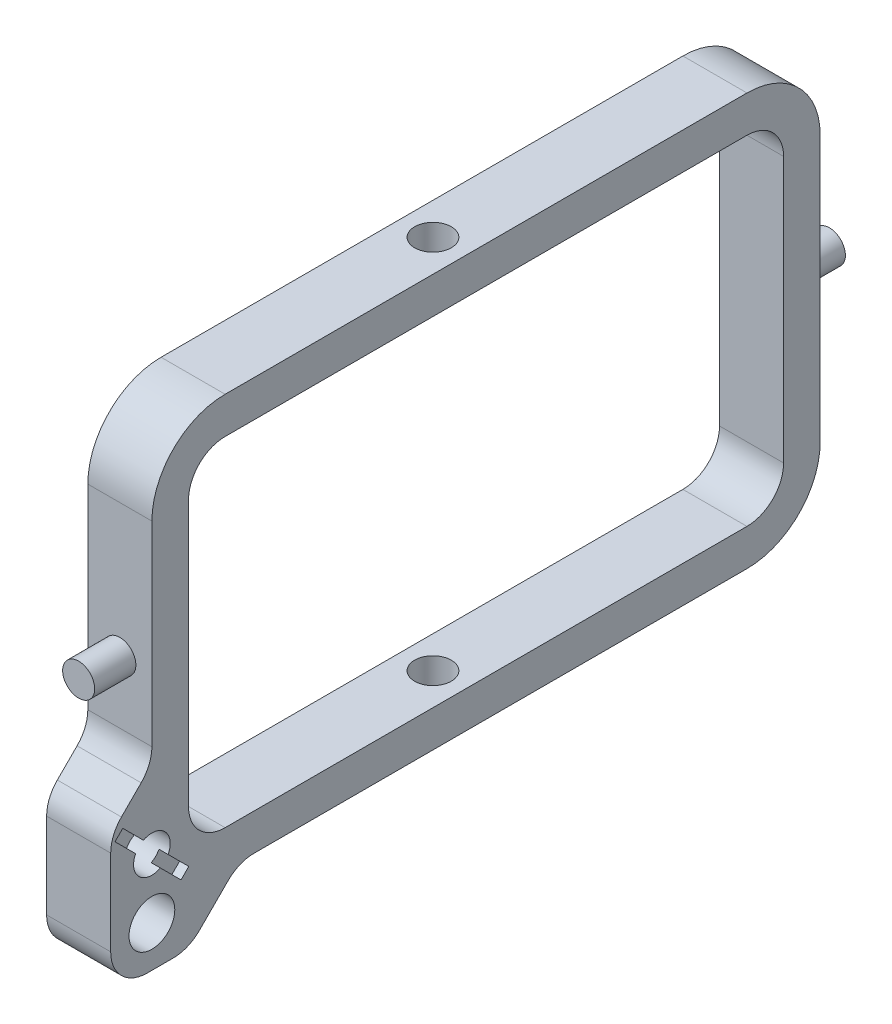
ISO-10303-21;
HEADER;
FILE_DESCRIPTION(('STEP AP214'),'2;1');
FILE_NAME('part.step','',(''),(''),'','','');
FILE_SCHEMA(('AUTOMOTIVE_DESIGN { 1 0 10303 214 1 1 1 1 }'));
ENDSEC;
DATA;
#1=APPLICATION_CONTEXT('core data for automotive mechanical design processes');
#2=APPLICATION_PROTOCOL_DEFINITION('international standard','automotive_design',2000,#1);
#3=PRODUCT_CONTEXT('',#1,'mechanical');
#4=PRODUCT('Part','Part','',(#3));
#5=PRODUCT_RELATED_PRODUCT_CATEGORY('part','',(#4));
#6=PRODUCT_DEFINITION_FORMATION('','',#4);
#7=PRODUCT_DEFINITION_CONTEXT('part definition',#1,'design');
#8=PRODUCT_DEFINITION('design','',#6,#7);
#9=PRODUCT_DEFINITION_SHAPE('','',#8);
#10=(LENGTH_UNIT() NAMED_UNIT(*) SI_UNIT(.MILLI.,.METRE.));
#11=(NAMED_UNIT(*) PLANE_ANGLE_UNIT() SI_UNIT($,.RADIAN.));
#12=(NAMED_UNIT(*) SI_UNIT($,.STERADIAN.) SOLID_ANGLE_UNIT());
#13=UNCERTAINTY_MEASURE_WITH_UNIT(LENGTH_MEASURE(1.E-05),#10,'distance_accuracy_value','');
#14=(GEOMETRIC_REPRESENTATION_CONTEXT(3) GLOBAL_UNCERTAINTY_ASSIGNED_CONTEXT((#13)) GLOBAL_UNIT_ASSIGNED_CONTEXT((#10,
#11,#12)) REPRESENTATION_CONTEXT('',''));
#15=CARTESIAN_POINT('',(0.,0.,0.));
#16=DIRECTION('',(0.,0.,1.));
#17=DIRECTION('',(1.,0.,0.));
#18=AXIS2_PLACEMENT_3D('',#15,#16,#17);
#19=CARTESIAN_POINT('',(7.,0.,0.));
#20=DIRECTION('',(1.,0.,0.));
#21=DIRECTION('',(0.,0.,-1.));
#22=AXIS2_PLACEMENT_3D('',#19,#20,#21);
#23=PLANE('',#22);
#24=DIRECTION('',(0.,0.707106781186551,0.707106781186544));
#25=VECTOR('',#24,1.);
#26=CARTESIAN_POINT('',(7.,-12.9694913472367,76.1819805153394));
#27=LINE('',#26,#25);
#28=CARTESIAN_POINT('',(7.,-20.1819805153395,68.9694913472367));
#29=VERTEX_POINT('',#28);
#30=CARTESIAN_POINT('',(7.,-17.9248096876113,71.2266621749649));
#31=VERTEX_POINT('',#30);
#32=EDGE_CURVE('E294',#29,#31,#27,.T.);
#33=ORIENTED_EDGE('',*,*,#32,.F.);
#34=DIRECTION('',(0.,0.707106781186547,-0.707106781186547));
#35=VECTOR('',#34,1.);
#36=CARTESIAN_POINT('',(7.,-20.1819805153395,68.9694913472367));
#37=LINE('',#36,#35);
#38=CARTESIAN_POINT('',(7.,-21.0305086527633,69.8180194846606));
#39=VERTEX_POINT('',#38);
#40=EDGE_CURVE('E266',#39,#29,#37,.T.);
#41=ORIENTED_EDGE('',*,*,#40,.F.);
#42=DIRECTION('',(0.,-0.70710678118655,-0.707106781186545));
#43=VECTOR('',#42,1.);
#44=CARTESIAN_POINT('',(7.,-21.0305086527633,69.8180194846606));
#45=LINE('',#44,#43);
#46=CARTESIAN_POINT('',(7.,-18.7733378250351,72.0751903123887));
#47=VERTEX_POINT('',#46);
#48=EDGE_CURVE('E300',#47,#39,#45,.T.);
#49=ORIENTED_EDGE('',*,*,#48,.F.);
#50=CARTESIAN_POINT('',(7.,-17.,73.));
#51=DIRECTION('',(1.,0.,0.));
#52=DIRECTION('',(0.,0.,-1.));
#53=AXIS2_PLACEMENT_3D('',#50,#51,#52);
#54=CIRCLE('',#53,2.);
#55=CARTESIAN_POINT('',(7.,-16.0751903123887,74.7733378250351));
#56=VERTEX_POINT('',#55);
#57=EDGE_CURVE('E346',#56,#47,#54,.T.);
#58=ORIENTED_EDGE('',*,*,#57,.F.);
#59=CARTESIAN_POINT('',(7.,-13.8180194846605,77.0305086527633));
#60=VERTEX_POINT('',#59);
#61=EDGE_CURVE('E301',#60,#56,#45,.T.);
#62=ORIENTED_EDGE('',*,*,#61,.F.);
#63=DIRECTION('',(0.,-0.707106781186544,0.707106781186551));
#64=VECTOR('',#63,1.);
#65=CARTESIAN_POINT('',(7.,-13.8180194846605,77.0305086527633));
#66=LINE('',#65,#64);
#67=CARTESIAN_POINT('',(7.,-12.9694913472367,76.1819805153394));
#68=VERTEX_POINT('',#67);
#69=EDGE_CURVE('E297',#68,#60,#66,.T.);
#70=ORIENTED_EDGE('',*,*,#69,.F.);
#71=CARTESIAN_POINT('',(7.,-15.2266621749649,73.9248096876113));
#72=VERTEX_POINT('',#71);
#73=EDGE_CURVE('E272',#72,#68,#27,.T.);
#74=ORIENTED_EDGE('',*,*,#73,.F.);
#75=EDGE_CURVE('E342',#31,#72,#54,.T.);
#76=ORIENTED_EDGE('',*,*,#75,.F.);
#77=EDGE_LOOP('',(#33,#41,#49,#58,#62,#70,#74,#76));
#78=FACE_BOUND('',#77,.T.);
#79=CARTESIAN_POINT('',(7.,-23.5,73.));
#80=DIRECTION('',(1.,0.,0.));
#81=DIRECTION('',(0.,0.,-1.));
#82=AXIS2_PLACEMENT_3D('',#79,#80,#81);
#83=CIRCLE('',#82,2.5);
#84=CARTESIAN_POINT('',(7.,-23.5,70.5));
#85=VERTEX_POINT('',#84);
#86=EDGE_CURVE('E350',#85,#85,#83,.T.);
#87=ORIENTED_EDGE('',*,*,#86,.F.);
#88=EDGE_LOOP('',(#87));
#89=FACE_BOUND('',#88,.T.);
#90=DIRECTION('',(0.,0.,-1.));
#91=VECTOR('',#90,1.);
#92=CARTESIAN_POINT('',(7.,-22.5,63.5));
#93=LINE('',#92,#91);
#94=CARTESIAN_POINT('',(7.,-22.5,61.8431457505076));
#95=VERTEX_POINT('',#94);
#96=CARTESIAN_POINT('',(7.,-22.5,7.99999999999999));
#97=VERTEX_POINT('',#96);
#98=EDGE_CURVE('E407',#95,#97,#93,.T.);
#99=ORIENTED_EDGE('',*,*,#98,.T.);
#100=CARTESIAN_POINT('',(7.,-14.5,8.));
#101=DIRECTION('',(1.,0.,0.));
#102=DIRECTION('',(0.,0.,-1.));
#103=AXIS2_PLACEMENT_3D('',#100,#101,#102);
#104=CIRCLE('',#103,8.);
#105=CARTESIAN_POINT('',(7.,-14.5,0.));
#106=VERTEX_POINT('',#105);
#107=EDGE_CURVE('E567',#97,#106,#104,.T.);
#108=ORIENTED_EDGE('',*,*,#107,.T.);
#109=DIRECTION('',(0.,1.,0.));
#110=VECTOR('',#109,1.);
#111=CARTESIAN_POINT('',(7.,-22.5,0.));
#112=LINE('',#111,#110);
#113=CARTESIAN_POINT('',(7.,14.5,0.));
#114=VERTEX_POINT('',#113);
#115=EDGE_CURVE('E411',#106,#114,#112,.T.);
#116=ORIENTED_EDGE('',*,*,#115,.T.);
#117=CARTESIAN_POINT('',(7.,14.5,8.));
#118=DIRECTION('',(1.,0.,0.));
#119=DIRECTION('',(0.,0.,-1.));
#120=AXIS2_PLACEMENT_3D('',#117,#118,#119);
#121=CIRCLE('',#120,8.);
#122=CARTESIAN_POINT('',(7.,22.5,8.));
#123=VERTEX_POINT('',#122);
#124=EDGE_CURVE('E564',#114,#123,#121,.T.);
#125=ORIENTED_EDGE('',*,*,#124,.T.);
#126=DIRECTION('',(0.,0.,1.));
#127=VECTOR('',#126,1.);
#128=CARTESIAN_POINT('',(7.,22.5,0.));
#129=LINE('',#128,#127);
#130=CARTESIAN_POINT('',(7.,22.5,65.));
#131=VERTEX_POINT('',#130);
#132=EDGE_CURVE('E415',#123,#131,#129,.T.);
#133=ORIENTED_EDGE('',*,*,#132,.T.);
#134=CARTESIAN_POINT('',(7.,14.5,65.));
#135=DIRECTION('',(1.,0.,0.));
#136=DIRECTION('',(0.,0.,-1.));
#137=AXIS2_PLACEMENT_3D('',#134,#135,#136);
#138=CIRCLE('',#137,8.);
#139=CARTESIAN_POINT('',(7.,14.5,73.));
#140=VERTEX_POINT('',#139);
#141=EDGE_CURVE('E561',#131,#140,#138,.T.);
#142=ORIENTED_EDGE('',*,*,#141,.T.);
#143=DIRECTION('',(0.,-1.,0.));
#144=VECTOR('',#143,1.);
#145=CARTESIAN_POINT('',(7.,22.5,73.));
#146=LINE('',#145,#144);
#147=CARTESIAN_POINT('',(7.,-6.84314575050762,73.));
#148=VERTEX_POINT('',#147);
#149=EDGE_CURVE('E419',#140,#148,#146,.T.);
#150=ORIENTED_EDGE('',*,*,#149,.T.);
#151=CARTESIAN_POINT('',(7.,-6.84314575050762,77.));
#152=DIRECTION('',(1.,0.,0.));
#153=DIRECTION('',(0.,0.,-1.));
#154=AXIS2_PLACEMENT_3D('',#151,#152,#153);
#155=CIRCLE('',#154,4.);
#156=CARTESIAN_POINT('',(7.,-9.67157287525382,74.1715728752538));
#157=VERTEX_POINT('',#156);
#158=EDGE_CURVE('E539',#148,#157,#155,.F.);
#159=ORIENTED_EDGE('',*,*,#158,.T.);
#160=DIRECTION('',(0.,-0.707106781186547,0.707106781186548));
#161=VECTOR('',#160,1.);
#162=CARTESIAN_POINT('',(7.,-8.50000000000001,73.));
#163=LINE('',#162,#161);
#164=CARTESIAN_POINT('',(7.,-11.8284271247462,76.3284271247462));
#165=VERTEX_POINT('',#164);
#166=EDGE_CURVE('E390',#157,#165,#163,.T.);
#167=ORIENTED_EDGE('',*,*,#166,.T.);
#168=CARTESIAN_POINT('',(7.,-14.6568542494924,73.5));
#169=DIRECTION('',(1.,0.,0.));
#170=DIRECTION('',(0.,0.,-1.));
#171=AXIS2_PLACEMENT_3D('',#168,#169,#170);
#172=CIRCLE('',#171,4.);
#173=CARTESIAN_POINT('',(7.,-14.6568542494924,77.5));
#174=VERTEX_POINT('',#173);
#175=EDGE_CURVE('E498',#165,#174,#172,.T.);
#176=ORIENTED_EDGE('',*,*,#175,.T.);
#177=DIRECTION('',(0.,-1.,0.));
#178=VECTOR('',#177,1.);
#179=CARTESIAN_POINT('',(7.,-13.,77.5));
#180=LINE('',#179,#178);
#181=CARTESIAN_POINT('',(7.,-24.,77.5));
#182=VERTEX_POINT('',#181);
#183=EDGE_CURVE('E394',#174,#182,#180,.T.);
#184=ORIENTED_EDGE('',*,*,#183,.T.);
#185=CARTESIAN_POINT('',(7.,-24.,73.5));
#186=DIRECTION('',(1.,0.,0.));
#187=DIRECTION('',(0.,0.,-1.));
#188=AXIS2_PLACEMENT_3D('',#185,#186,#187);
#189=CIRCLE('',#188,4.);
#190=CARTESIAN_POINT('',(7.,-28.,73.5));
#191=VERTEX_POINT('',#190);
#192=EDGE_CURVE('E501',#182,#191,#189,.T.);
#193=ORIENTED_EDGE('',*,*,#192,.T.);
#194=DIRECTION('',(0.,0.,-1.));
#195=VECTOR('',#194,1.);
#196=CARTESIAN_POINT('',(7.,-28.,77.5));
#197=LINE('',#196,#195);
#198=CARTESIAN_POINT('',(7.,-28.,70.6568542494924));
#199=VERTEX_POINT('',#198);
#200=EDGE_CURVE('E399',#191,#199,#197,.T.);
#201=ORIENTED_EDGE('',*,*,#200,.T.);
#202=CARTESIAN_POINT('',(7.,-24.,70.6568542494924));
#203=DIRECTION('',(1.,0.,0.));
#204=DIRECTION('',(0.,0.,-1.));
#205=AXIS2_PLACEMENT_3D('',#202,#203,#204);
#206=CIRCLE('',#205,4.);
#207=CARTESIAN_POINT('',(7.,-26.8284271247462,67.8284271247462));
#208=VERTEX_POINT('',#207);
#209=EDGE_CURVE('E504',#199,#208,#206,.T.);
#210=ORIENTED_EDGE('',*,*,#209,.T.);
#211=DIRECTION('',(0.,0.707106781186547,-0.707106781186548));
#212=VECTOR('',#211,1.);
#213=CARTESIAN_POINT('',(7.,-28.,69.));
#214=LINE('',#213,#212);
#215=CARTESIAN_POINT('',(7.,-23.6715728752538,64.6715728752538));
#216=VERTEX_POINT('',#215);
#217=EDGE_CURVE('E403',#208,#216,#214,.T.);
#218=ORIENTED_EDGE('',*,*,#217,.T.);
#219=CARTESIAN_POINT('',(7.,-26.5,61.8431457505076));
#220=DIRECTION('',(1.,0.,0.));
#221=DIRECTION('',(0.,0.,-1.));
#222=AXIS2_PLACEMENT_3D('',#219,#220,#221);
#223=CIRCLE('',#222,4.);
#224=EDGE_CURVE('E532',#216,#95,#223,.F.);
#225=ORIENTED_EDGE('',*,*,#224,.T.);
#226=EDGE_LOOP('',(#99,#108,#116,#125,#133,#142,#150,#159,#167,#176,#184,#193,#201,#210,#218,#225));
#227=FACE_BOUND('',#226,.T.);
#228=DIRECTION('',(0.,-1.,0.));
#229=VECTOR('',#228,1.);
#230=CARTESIAN_POINT('',(7.,18.5,69.));
#231=LINE('',#230,#229);
#232=CARTESIAN_POINT('',(7.,14.5,69.));
#233=VERTEX_POINT('',#232);
#234=CARTESIAN_POINT('',(7.,-14.5,69.));
#235=VERTEX_POINT('',#234);
#236=EDGE_CURVE('E362',#233,#235,#231,.T.);
#237=ORIENTED_EDGE('',*,*,#236,.F.);
#238=CARTESIAN_POINT('',(7.,14.5,65.));
#239=DIRECTION('',(1.,0.,0.));
#240=DIRECTION('',(0.,0.,-1.));
#241=AXIS2_PLACEMENT_3D('',#238,#239,#240);
#242=CIRCLE('',#241,4.);
#243=CARTESIAN_POINT('',(7.,18.5,65.));
#244=VERTEX_POINT('',#243);
#245=EDGE_CURVE('E11',#233,#244,#242,.F.);
#246=ORIENTED_EDGE('',*,*,#245,.T.);
#247=DIRECTION('',(0.,0.,1.));
#248=VECTOR('',#247,1.);
#249=CARTESIAN_POINT('',(7.,18.5,4.));
#250=LINE('',#249,#248);
#251=CARTESIAN_POINT('',(7.,18.5,8.));
#252=VERTEX_POINT('',#251);
#253=EDGE_CURVE('E359',#252,#244,#250,.T.);
#254=ORIENTED_EDGE('',*,*,#253,.F.);
#255=CARTESIAN_POINT('',(7.,14.5,8.));
#256=DIRECTION('',(1.,0.,0.));
#257=DIRECTION('',(0.,0.,-1.));
#258=AXIS2_PLACEMENT_3D('',#255,#256,#257);
#259=CIRCLE('',#258,4.);
#260=CARTESIAN_POINT('',(7.,14.5,4.));
#261=VERTEX_POINT('',#260);
#262=EDGE_CURVE('E623',#252,#261,#259,.F.);
#263=ORIENTED_EDGE('',*,*,#262,.T.);
#264=DIRECTION('',(0.,1.,0.));
#265=VECTOR('',#264,1.);
#266=CARTESIAN_POINT('',(7.,-18.5,4.));
#267=LINE('',#266,#265);
#268=CARTESIAN_POINT('',(7.,-14.5,4.));
#269=VERTEX_POINT('',#268);
#270=EDGE_CURVE('E371',#269,#261,#267,.T.);
#271=ORIENTED_EDGE('',*,*,#270,.F.);
#272=CARTESIAN_POINT('',(7.,-14.5,8.00000000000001));
#273=DIRECTION('',(1.,0.,0.));
#274=DIRECTION('',(0.,0.,-1.));
#275=AXIS2_PLACEMENT_3D('',#272,#273,#274);
#276=CIRCLE('',#275,4.);
#277=CARTESIAN_POINT('',(7.,-18.5,8.00000000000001));
#278=VERTEX_POINT('',#277);
#279=EDGE_CURVE('E617',#269,#278,#276,.F.);
#280=ORIENTED_EDGE('',*,*,#279,.T.);
#281=DIRECTION('',(0.,0.,-1.));
#282=VECTOR('',#281,1.);
#283=CARTESIAN_POINT('',(7.,-18.5,69.));
#284=LINE('',#283,#282);
#285=CARTESIAN_POINT('',(7.,-18.5,65.));
#286=VERTEX_POINT('',#285);
#287=EDGE_CURVE('E367',#286,#278,#284,.T.);
#288=ORIENTED_EDGE('',*,*,#287,.F.);
#289=CARTESIAN_POINT('',(7.,-14.5,65.));
#290=DIRECTION('',(1.,0.,0.));
#291=DIRECTION('',(0.,0.,-1.));
#292=AXIS2_PLACEMENT_3D('',#289,#290,#291);
#293=CIRCLE('',#292,4.);
#294=EDGE_CURVE('E611',#286,#235,#293,.F.);
#295=ORIENTED_EDGE('',*,*,#294,.T.);
#296=EDGE_LOOP('',(#237,#246,#254,#263,#271,#280,#288,#295));
#297=FACE_BOUND('',#296,.T.);
#298=ADVANCED_FACE('F45',(#78,#89,#227,#297),#23,.T.);
#299=CARTESIAN_POINT('',(0.,0.,0.));
#300=DIRECTION('',(1.,0.,0.));
#301=DIRECTION('',(0.,0.,-1.));
#302=AXIS2_PLACEMENT_3D('',#299,#300,#301);
#303=PLANE('',#302);
#304=DIRECTION('',(0.,1.,0.));
#305=VECTOR('',#304,1.);
#306=CARTESIAN_POINT('',(0.,-22.5,0.));
#307=LINE('',#306,#305);
#308=CARTESIAN_POINT('',(0.,-14.5,0.));
#309=VERTEX_POINT('',#308);
#310=CARTESIAN_POINT('',(0.,14.5,0.));
#311=VERTEX_POINT('',#310);
#312=EDGE_CURVE('E442',#309,#311,#307,.T.);
#313=ORIENTED_EDGE('',*,*,#312,.F.);
#314=CARTESIAN_POINT('',(0.,-14.5,8.));
#315=DIRECTION('',(1.,0.,0.));
#316=DIRECTION('',(0.,0.,-1.));
#317=AXIS2_PLACEMENT_3D('',#314,#315,#316);
#318=CIRCLE('',#317,8.);
#319=CARTESIAN_POINT('',(0.,-22.5,7.99999999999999));
#320=VERTEX_POINT('',#319);
#321=EDGE_CURVE('E555',#309,#320,#318,.F.);
#322=ORIENTED_EDGE('',*,*,#321,.T.);
#323=DIRECTION('',(0.,0.,-1.));
#324=VECTOR('',#323,1.);
#325=CARTESIAN_POINT('',(0.,-22.5,63.5));
#326=LINE('',#325,#324);
#327=CARTESIAN_POINT('',(0.,-22.5,61.8431457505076));
#328=VERTEX_POINT('',#327);
#329=EDGE_CURVE('E438',#328,#320,#326,.T.);
#330=ORIENTED_EDGE('',*,*,#329,.F.);
#331=CARTESIAN_POINT('',(0.,-26.5,61.8431457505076));
#332=DIRECTION('',(1.,0.,0.));
#333=DIRECTION('',(0.,0.,-1.));
#334=AXIS2_PLACEMENT_3D('',#331,#332,#333);
#335=CIRCLE('',#334,4.);
#336=CARTESIAN_POINT('',(0.,-23.6715728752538,64.6715728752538));
#337=VERTEX_POINT('',#336);
#338=EDGE_CURVE('E529',#328,#337,#335,.T.);
#339=ORIENTED_EDGE('',*,*,#338,.T.);
#340=DIRECTION('',(0.,0.707106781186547,-0.707106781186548));
#341=VECTOR('',#340,1.);
#342=CARTESIAN_POINT('',(0.,-28.,69.));
#343=LINE('',#342,#341);
#344=CARTESIAN_POINT('',(0.,-26.8284271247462,67.8284271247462));
#345=VERTEX_POINT('',#344);
#346=EDGE_CURVE('E434',#345,#337,#343,.T.);
#347=ORIENTED_EDGE('',*,*,#346,.F.);
#348=CARTESIAN_POINT('',(0.,-24.,70.6568542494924));
#349=DIRECTION('',(1.,0.,0.));
#350=DIRECTION('',(0.,0.,-1.));
#351=AXIS2_PLACEMENT_3D('',#348,#349,#350);
#352=CIRCLE('',#351,4.);
#353=CARTESIAN_POINT('',(0.,-28.,70.6568542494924));
#354=VERTEX_POINT('',#353);
#355=EDGE_CURVE('E488',#345,#354,#352,.F.);
#356=ORIENTED_EDGE('',*,*,#355,.T.);
#357=DIRECTION('',(0.,0.,-1.));
#358=VECTOR('',#357,1.);
#359=CARTESIAN_POINT('',(0.,-28.,77.5));
#360=LINE('',#359,#358);
#361=CARTESIAN_POINT('',(0.,-28.,73.5));
#362=VERTEX_POINT('',#361);
#363=EDGE_CURVE('E430',#362,#354,#360,.T.);
#364=ORIENTED_EDGE('',*,*,#363,.F.);
#365=CARTESIAN_POINT('',(0.,-24.,73.5));
#366=DIRECTION('',(1.,0.,0.));
#367=DIRECTION('',(0.,0.,-1.));
#368=AXIS2_PLACEMENT_3D('',#365,#366,#367);
#369=CIRCLE('',#368,4.);
#370=CARTESIAN_POINT('',(0.,-24.,77.5));
#371=VERTEX_POINT('',#370);
#372=EDGE_CURVE('E485',#362,#371,#369,.F.);
#373=ORIENTED_EDGE('',*,*,#372,.T.);
#374=DIRECTION('',(0.,-1.,0.));
#375=VECTOR('',#374,1.);
#376=CARTESIAN_POINT('',(0.,-13.,77.5));
#377=LINE('',#376,#375);
#378=CARTESIAN_POINT('',(0.,-14.6568542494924,77.5));
#379=VERTEX_POINT('',#378);
#380=EDGE_CURVE('E426',#379,#371,#377,.T.);
#381=ORIENTED_EDGE('',*,*,#380,.F.);
#382=CARTESIAN_POINT('',(0.,-14.6568542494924,73.5));
#383=DIRECTION('',(1.,0.,0.));
#384=DIRECTION('',(0.,0.,-1.));
#385=AXIS2_PLACEMENT_3D('',#382,#383,#384);
#386=CIRCLE('',#385,4.);
#387=CARTESIAN_POINT('',(0.,-11.8284271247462,76.3284271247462));
#388=VERTEX_POINT('',#387);
#389=EDGE_CURVE('E482',#379,#388,#386,.F.);
#390=ORIENTED_EDGE('',*,*,#389,.T.);
#391=DIRECTION('',(0.,-0.707106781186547,0.707106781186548));
#392=VECTOR('',#391,1.);
#393=CARTESIAN_POINT('',(0.,-8.50000000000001,73.));
#394=LINE('',#393,#392);
#395=CARTESIAN_POINT('',(0.,-9.67157287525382,74.1715728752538));
#396=VERTEX_POINT('',#395);
#397=EDGE_CURVE('E375',#396,#388,#394,.T.);
#398=ORIENTED_EDGE('',*,*,#397,.F.);
#399=CARTESIAN_POINT('',(0.,-6.84314575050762,77.));
#400=DIRECTION('',(1.,0.,0.));
#401=DIRECTION('',(0.,0.,-1.));
#402=AXIS2_PLACEMENT_3D('',#399,#400,#401);
#403=CIRCLE('',#402,4.);
#404=CARTESIAN_POINT('',(0.,-6.84314575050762,73.));
#405=VERTEX_POINT('',#404);
#406=EDGE_CURVE('E535',#396,#405,#403,.T.);
#407=ORIENTED_EDGE('',*,*,#406,.T.);
#408=DIRECTION('',(0.,-1.,0.));
#409=VECTOR('',#408,1.);
#410=CARTESIAN_POINT('',(0.,22.5,73.));
#411=LINE('',#410,#409);
#412=CARTESIAN_POINT('',(0.,14.5,73.));
#413=VERTEX_POINT('',#412);
#414=EDGE_CURVE('E395',#413,#405,#411,.T.);
#415=ORIENTED_EDGE('',*,*,#414,.F.);
#416=CARTESIAN_POINT('',(0.,14.5,65.));
#417=DIRECTION('',(1.,0.,0.));
#418=DIRECTION('',(0.,0.,-1.));
#419=AXIS2_PLACEMENT_3D('',#416,#417,#418);
#420=CIRCLE('',#419,8.);
#421=CARTESIAN_POINT('',(0.,22.5,65.));
#422=VERTEX_POINT('',#421);
#423=EDGE_CURVE('E549',#413,#422,#420,.F.);
#424=ORIENTED_EDGE('',*,*,#423,.T.);
#425=DIRECTION('',(0.,0.,1.));
#426=VECTOR('',#425,1.);
#427=CARTESIAN_POINT('',(0.,22.5,0.));
#428=LINE('',#427,#426);
#429=CARTESIAN_POINT('',(0.,22.5,8.));
#430=VERTEX_POINT('',#429);
#431=EDGE_CURVE('E446',#430,#422,#428,.T.);
#432=ORIENTED_EDGE('',*,*,#431,.F.);
#433=CARTESIAN_POINT('',(0.,14.5,8.));
#434=DIRECTION('',(1.,0.,0.));
#435=DIRECTION('',(0.,0.,-1.));
#436=AXIS2_PLACEMENT_3D('',#433,#434,#435);
#437=CIRCLE('',#436,8.);
#438=EDGE_CURVE('E552',#430,#311,#437,.F.);
#439=ORIENTED_EDGE('',*,*,#438,.T.);
#440=EDGE_LOOP('',(#313,#322,#330,#339,#347,#356,#364,#373,#381,#390,#398,#407,#415,#424,#432,#439));
#441=FACE_BOUND('',#440,.T.);
#442=DIRECTION('',(0.,1.,0.));
#443=VECTOR('',#442,1.);
#444=CARTESIAN_POINT('',(0.,-18.5,4.));
#445=LINE('',#444,#443);
#446=CARTESIAN_POINT('',(0.,-14.5,4.));
#447=VERTEX_POINT('',#446);
#448=CARTESIAN_POINT('',(0.,14.5,4.));
#449=VERTEX_POINT('',#448);
#450=EDGE_CURVE('E363',#447,#449,#445,.T.);
#451=ORIENTED_EDGE('',*,*,#450,.T.);
#452=CARTESIAN_POINT('',(0.,14.5,8.));
#453=DIRECTION('',(1.,0.,0.));
#454=DIRECTION('',(0.,0.,-1.));
#455=AXIS2_PLACEMENT_3D('',#452,#453,#454);
#456=CIRCLE('',#455,4.);
#457=CARTESIAN_POINT('',(0.,18.5,8.));
#458=VERTEX_POINT('',#457);
#459=EDGE_CURVE('E620',#449,#458,#456,.T.);
#460=ORIENTED_EDGE('',*,*,#459,.T.);
#461=DIRECTION('',(0.,0.,1.));
#462=VECTOR('',#461,1.);
#463=CARTESIAN_POINT('',(0.,18.5,4.));
#464=LINE('',#463,#462);
#465=CARTESIAN_POINT('',(0.,18.5,65.));
#466=VERTEX_POINT('',#465);
#467=EDGE_CURVE('E354',#458,#466,#464,.T.);
#468=ORIENTED_EDGE('',*,*,#467,.T.);
#469=CARTESIAN_POINT('',(0.,14.5,65.));
#470=DIRECTION('',(1.,0.,0.));
#471=DIRECTION('',(0.,0.,-1.));
#472=AXIS2_PLACEMENT_3D('',#469,#470,#471);
#473=CIRCLE('',#472,4.);
#474=CARTESIAN_POINT('',(0.,14.5,69.));
#475=VERTEX_POINT('',#474);
#476=EDGE_CURVE('E54',#466,#475,#473,.T.);
#477=ORIENTED_EDGE('',*,*,#476,.T.);
#478=DIRECTION('',(0.,-1.,0.));
#479=VECTOR('',#478,1.);
#480=CARTESIAN_POINT('',(0.,18.5,69.));
#481=LINE('',#480,#479);
#482=CARTESIAN_POINT('',(0.,-14.5,69.));
#483=VERTEX_POINT('',#482);
#484=EDGE_CURVE('E379',#475,#483,#481,.T.);
#485=ORIENTED_EDGE('',*,*,#484,.T.);
#486=CARTESIAN_POINT('',(0.,-14.5,65.));
#487=DIRECTION('',(1.,0.,0.));
#488=DIRECTION('',(0.,0.,-1.));
#489=AXIS2_PLACEMENT_3D('',#486,#487,#488);
#490=CIRCLE('',#489,4.);
#491=CARTESIAN_POINT('',(0.,-18.5,65.));
#492=VERTEX_POINT('',#491);
#493=EDGE_CURVE('E608',#483,#492,#490,.T.);
#494=ORIENTED_EDGE('',*,*,#493,.T.);
#495=DIRECTION('',(0.,0.,-1.));
#496=VECTOR('',#495,1.);
#497=CARTESIAN_POINT('',(0.,-18.5,69.));
#498=LINE('',#497,#496);
#499=CARTESIAN_POINT('',(0.,-18.5,8.00000000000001));
#500=VERTEX_POINT('',#499);
#501=EDGE_CURVE('E383',#492,#500,#498,.T.);
#502=ORIENTED_EDGE('',*,*,#501,.T.);
#503=CARTESIAN_POINT('',(0.,-14.5,8.00000000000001));
#504=DIRECTION('',(1.,0.,0.));
#505=DIRECTION('',(0.,0.,-1.));
#506=AXIS2_PLACEMENT_3D('',#503,#504,#505);
#507=CIRCLE('',#506,4.);
#508=EDGE_CURVE('E614',#500,#447,#507,.T.);
#509=ORIENTED_EDGE('',*,*,#508,.T.);
#510=EDGE_LOOP('',(#451,#460,#468,#477,#485,#494,#502,#509));
#511=FACE_BOUND('',#510,.T.);
#512=CARTESIAN_POINT('',(0.,-23.5,73.));
#513=DIRECTION('',(1.,0.,0.));
#514=DIRECTION('',(0.,0.,-1.));
#515=AXIS2_PLACEMENT_3D('',#512,#513,#514);
#516=CIRCLE('',#515,2.5);
#517=CARTESIAN_POINT('',(0.,-23.5,70.5));
#518=VERTEX_POINT('',#517);
#519=EDGE_CURVE('E355',#518,#518,#516,.T.);
#520=ORIENTED_EDGE('',*,*,#519,.T.);
#521=EDGE_LOOP('',(#520));
#522=FACE_BOUND('',#521,.T.);
#523=CARTESIAN_POINT('',(0.,-17.,73.));
#524=DIRECTION('',(1.,0.,0.));
#525=DIRECTION('',(0.,0.,-1.));
#526=AXIS2_PLACEMENT_3D('',#523,#524,#525);
#527=CIRCLE('',#526,2.);
#528=CARTESIAN_POINT('',(0.,-17.,71.));
#529=VERTEX_POINT('',#528);
#530=EDGE_CURVE('E341',#529,#529,#527,.T.);
#531=ORIENTED_EDGE('',*,*,#530,.T.);
#532=EDGE_LOOP('',(#531));
#533=FACE_BOUND('',#532,.T.);
#534=ADVANCED_FACE('F628',(#441,#511,#522,#533),#303,.F.);
#535=CARTESIAN_POINT('',(7.,-8.50000000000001,73.));
#536=DIRECTION('',(0.,-0.707106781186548,-0.707106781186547));
#537=DIRECTION('',(0.,0.707106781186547,-0.707106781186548));
#538=AXIS2_PLACEMENT_3D('',#535,#536,#537);
#539=PLANE('',#538);
#540=ORIENTED_EDGE('',*,*,#397,.T.);
#541=DIRECTION('',(-1.,0.,0.));
#542=VECTOR('',#541,1.);
#543=CARTESIAN_POINT('',(7.,-11.8284271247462,76.3284271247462));
#544=LINE('',#543,#542);
#545=EDGE_CURVE('E522',#388,#165,#544,.F.);
#546=ORIENTED_EDGE('',*,*,#545,.T.);
#547=ORIENTED_EDGE('',*,*,#166,.F.);
#548=DIRECTION('',(-1.,0.,0.));
#549=VECTOR('',#548,1.);
#550=CARTESIAN_POINT('',(0.,-9.67157287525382,74.1715728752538));
#551=LINE('',#550,#549);
#552=EDGE_CURVE('E518',#157,#396,#551,.T.);
#553=ORIENTED_EDGE('',*,*,#552,.T.);
#554=EDGE_LOOP('',(#540,#546,#547,#553));
#555=FACE_BOUND('',#554,.T.);
#556=ADVANCED_FACE('F676',(#555),#539,.F.);
#557=CARTESIAN_POINT('',(7.,-13.,77.5));
#558=DIRECTION('',(0.,0.,-1.));
#559=DIRECTION('',(-1.,0.,0.));
#560=AXIS2_PLACEMENT_3D('',#557,#558,#559);
#561=PLANE('',#560);
#562=ORIENTED_EDGE('',*,*,#380,.T.);
#563=DIRECTION('',(-1.,0.,0.));
#564=VECTOR('',#563,1.);
#565=CARTESIAN_POINT('',(7.,-24.,77.5));
#566=LINE('',#565,#564);
#567=EDGE_CURVE('E515',#371,#182,#566,.F.);
#568=ORIENTED_EDGE('',*,*,#567,.T.);
#569=ORIENTED_EDGE('',*,*,#183,.F.);
#570=DIRECTION('',(-1.,0.,0.));
#571=VECTOR('',#570,1.);
#572=CARTESIAN_POINT('',(7.,-14.6568542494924,77.5));
#573=LINE('',#572,#571);
#574=EDGE_CURVE('E511',#174,#379,#573,.T.);
#575=ORIENTED_EDGE('',*,*,#574,.T.);
#576=EDGE_LOOP('',(#562,#568,#569,#575));
#577=FACE_BOUND('',#576,.T.);
#578=ADVANCED_FACE('F707',(#577),#561,.F.);
#579=CARTESIAN_POINT('',(7.,-28.,77.5));
#580=DIRECTION('',(0.,1.,0.));
#581=DIRECTION('',(0.,0.,1.));
#582=AXIS2_PLACEMENT_3D('',#579,#580,#581);
#583=PLANE('',#582);
#584=ORIENTED_EDGE('',*,*,#363,.T.);
#585=DIRECTION('',(-1.,0.,0.));
#586=VECTOR('',#585,1.);
#587=CARTESIAN_POINT('',(7.,-28.,70.6568542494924));
#588=LINE('',#587,#586);
#589=EDGE_CURVE('E495',#354,#199,#588,.F.);
#590=ORIENTED_EDGE('',*,*,#589,.T.);
#591=ORIENTED_EDGE('',*,*,#200,.F.);
#592=DIRECTION('',(-1.,0.,0.));
#593=VECTOR('',#592,1.);
#594=CARTESIAN_POINT('',(7.,-28.,73.5));
#595=LINE('',#594,#593);
#596=EDGE_CURVE('E491',#191,#362,#595,.T.);
#597=ORIENTED_EDGE('',*,*,#596,.T.);
#598=EDGE_LOOP('',(#584,#590,#591,#597));
#599=FACE_BOUND('',#598,.T.);
#600=ADVANCED_FACE('F703',(#599),#583,.F.);
#601=CARTESIAN_POINT('',(7.,-28.,69.));
#602=DIRECTION('',(0.,0.707106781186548,0.707106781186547));
#603=DIRECTION('',(0.,-0.707106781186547,0.707106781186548));
#604=AXIS2_PLACEMENT_3D('',#601,#602,#603);
#605=PLANE('',#604);
#606=ORIENTED_EDGE('',*,*,#217,.F.);
#607=DIRECTION('',(-1.,0.,0.));
#608=VECTOR('',#607,1.);
#609=CARTESIAN_POINT('',(7.,-26.8284271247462,67.8284271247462));
#610=LINE('',#609,#608);
#611=EDGE_CURVE('E478',#208,#345,#610,.T.);
#612=ORIENTED_EDGE('',*,*,#611,.T.);
#613=ORIENTED_EDGE('',*,*,#346,.T.);
#614=DIRECTION('',(-1.,0.,0.));
#615=VECTOR('',#614,1.);
#616=CARTESIAN_POINT('',(7.,-23.6715728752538,64.6715728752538));
#617=LINE('',#616,#615);
#618=EDGE_CURVE('E475',#337,#216,#617,.F.);
#619=ORIENTED_EDGE('',*,*,#618,.T.);
#620=EDGE_LOOP('',(#606,#612,#613,#619));
#621=FACE_BOUND('',#620,.T.);
#622=ADVANCED_FACE('F699',(#621),#605,.F.);
#623=CARTESIAN_POINT('',(7.,-22.5,63.5));
#624=DIRECTION('',(0.,1.,0.));
#625=DIRECTION('',(0.,0.,1.));
#626=AXIS2_PLACEMENT_3D('',#623,#624,#625);
#627=PLANE('',#626);
#628=CARTESIAN_POINT('',(3.5,-22.5,38.8));
#629=DIRECTION('',(0.,-1.,0.));
#630=DIRECTION('',(0.,0.,-1.));
#631=AXIS2_PLACEMENT_3D('',#628,#629,#630);
#632=CIRCLE('',#631,2.);
#633=CARTESIAN_POINT('',(3.5,-22.5,36.8));
#634=VERTEX_POINT('',#633);
#635=EDGE_CURVE('E328',#634,#634,#632,.T.);
#636=ORIENTED_EDGE('',*,*,#635,.F.);
#637=EDGE_LOOP('',(#636));
#638=FACE_BOUND('',#637,.T.);
#639=ORIENTED_EDGE('',*,*,#329,.T.);
#640=DIRECTION('',(-1.,0.,0.));
#641=VECTOR('',#640,1.);
#642=CARTESIAN_POINT('',(7.,-22.5,7.99999999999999));
#643=LINE('',#642,#641);
#644=EDGE_CURVE('E558',#320,#97,#643,.F.);
#645=ORIENTED_EDGE('',*,*,#644,.T.);
#646=ORIENTED_EDGE('',*,*,#98,.F.);
#647=DIRECTION('',(-1.,0.,0.));
#648=VECTOR('',#647,1.);
#649=CARTESIAN_POINT('',(0.,-22.5,61.8431457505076));
#650=LINE('',#649,#648);
#651=EDGE_CURVE('E507',#95,#328,#650,.T.);
#652=ORIENTED_EDGE('',*,*,#651,.T.);
#653=EDGE_LOOP('',(#639,#645,#646,#652));
#654=FACE_BOUND('',#653,.T.);
#655=ADVANCED_FACE('F695',(#638,#654),#627,.F.);
#656=CARTESIAN_POINT('',(7.,-22.5,0.));
#657=DIRECTION('',(0.,0.,1.));
#658=DIRECTION('',(1.,0.,0.));
#659=AXIS2_PLACEMENT_3D('',#656,#657,#658);
#660=PLANE('',#659);
#661=CARTESIAN_POINT('',(3.5,0.,0.));
#662=DIRECTION('',(0.,0.,1.));
#663=DIRECTION('',(1.,0.,0.));
#664=AXIS2_PLACEMENT_3D('',#661,#662,#663);
#665=CIRCLE('',#664,1.75);
#666=CARTESIAN_POINT('',(5.25,0.,0.));
#667=VERTEX_POINT('',#666);
#668=EDGE_CURVE('E422',#667,#667,#665,.F.);
#669=ORIENTED_EDGE('',*,*,#668,.F.);
#670=EDGE_LOOP('',(#669));
#671=FACE_BOUND('',#670,.T.);
#672=ORIENTED_EDGE('',*,*,#115,.F.);
#673=DIRECTION('',(-1.,0.,0.));
#674=VECTOR('',#673,1.);
#675=CARTESIAN_POINT('',(7.,-14.5,0.));
#676=LINE('',#675,#674);
#677=EDGE_CURVE('E545',#106,#309,#676,.T.);
#678=ORIENTED_EDGE('',*,*,#677,.T.);
#679=ORIENTED_EDGE('',*,*,#312,.T.);
#680=DIRECTION('',(-1.,0.,0.));
#681=VECTOR('',#680,1.);
#682=CARTESIAN_POINT('',(7.,14.5,0.));
#683=LINE('',#682,#681);
#684=EDGE_CURVE('E542',#311,#114,#683,.F.);
#685=ORIENTED_EDGE('',*,*,#684,.T.);
#686=EDGE_LOOP('',(#672,#678,#679,#685));
#687=FACE_BOUND('',#686,.T.);
#688=ADVANCED_FACE('F691',(#671,#687),#660,.F.);
#689=CARTESIAN_POINT('',(7.,22.5,0.));
#690=DIRECTION('',(0.,-1.,0.));
#691=DIRECTION('',(0.,0.,-1.));
#692=AXIS2_PLACEMENT_3D('',#689,#690,#691);
#693=PLANE('',#692);
#694=CARTESIAN_POINT('',(3.5,22.5,38.8));
#695=DIRECTION('',(0.,-1.,0.));
#696=DIRECTION('',(0.,0.,-1.));
#697=AXIS2_PLACEMENT_3D('',#694,#695,#696);
#698=CIRCLE('',#697,2.);
#699=CARTESIAN_POINT('',(3.5,22.5,36.8));
#700=VERTEX_POINT('',#699);
#701=EDGE_CURVE('E329',#700,#700,#698,.T.);
#702=ORIENTED_EDGE('',*,*,#701,.T.);
#703=EDGE_LOOP('',(#702));
#704=FACE_BOUND('',#703,.T.);
#705=ORIENTED_EDGE('',*,*,#132,.F.);
#706=DIRECTION('',(-1.,0.,0.));
#707=VECTOR('',#706,1.);
#708=CARTESIAN_POINT('',(7.,22.5,8.));
#709=LINE('',#708,#707);
#710=EDGE_CURVE('E573',#123,#430,#709,.T.);
#711=ORIENTED_EDGE('',*,*,#710,.T.);
#712=ORIENTED_EDGE('',*,*,#431,.T.);
#713=DIRECTION('',(-1.,0.,0.));
#714=VECTOR('',#713,1.);
#715=CARTESIAN_POINT('',(7.,22.5,65.));
#716=LINE('',#715,#714);
#717=EDGE_CURVE('E570',#422,#131,#716,.F.);
#718=ORIENTED_EDGE('',*,*,#717,.T.);
#719=EDGE_LOOP('',(#705,#711,#712,#718));
#720=FACE_BOUND('',#719,.T.);
#721=ADVANCED_FACE('F687',(#704,#720),#693,.F.);
#722=CARTESIAN_POINT('',(7.,22.5,73.));
#723=DIRECTION('',(0.,0.,-1.));
#724=DIRECTION('',(-1.,0.,0.));
#725=AXIS2_PLACEMENT_3D('',#722,#723,#724);
#726=PLANE('',#725);
#727=CARTESIAN_POINT('',(3.5,0.,73.));
#728=DIRECTION('',(0.,0.,-1.));
#729=DIRECTION('',(-1.,0.,0.));
#730=AXIS2_PLACEMENT_3D('',#727,#728,#729);
#731=CIRCLE('',#730,1.75);
#732=CARTESIAN_POINT('',(1.75,0.,73.));
#733=VERTEX_POINT('',#732);
#734=EDGE_CURVE('E310',#733,#733,#731,.T.);
#735=ORIENTED_EDGE('',*,*,#734,.T.);
#736=EDGE_LOOP('',(#735));
#737=FACE_BOUND('',#736,.T.);
#738=ORIENTED_EDGE('',*,*,#149,.F.);
#739=DIRECTION('',(-1.,0.,0.));
#740=VECTOR('',#739,1.);
#741=CARTESIAN_POINT('',(7.,14.5,73.));
#742=LINE('',#741,#740);
#743=EDGE_CURVE('E577',#140,#413,#742,.T.);
#744=ORIENTED_EDGE('',*,*,#743,.T.);
#745=ORIENTED_EDGE('',*,*,#414,.T.);
#746=DIRECTION('',(-1.,0.,0.));
#747=VECTOR('',#746,1.);
#748=CARTESIAN_POINT('',(7.,-6.84314575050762,73.));
#749=LINE('',#748,#747);
#750=EDGE_CURVE('E525',#405,#148,#749,.F.);
#751=ORIENTED_EDGE('',*,*,#750,.T.);
#752=EDGE_LOOP('',(#738,#744,#745,#751));
#753=FACE_BOUND('',#752,.T.);
#754=ADVANCED_FACE('F684',(#737,#753),#726,.F.);
#755=CARTESIAN_POINT('',(7.,18.5,4.));
#756=DIRECTION('',(0.,-1.,0.));
#757=DIRECTION('',(0.,0.,-1.));
#758=AXIS2_PLACEMENT_3D('',#755,#756,#757);
#759=PLANE('',#758);
#760=CARTESIAN_POINT('',(3.5,18.5,38.8));
#761=DIRECTION('',(0.,-1.,0.));
#762=DIRECTION('',(0.,0.,-1.));
#763=AXIS2_PLACEMENT_3D('',#760,#761,#762);
#764=CIRCLE('',#763,2.);
#765=CARTESIAN_POINT('',(3.5,18.5,36.8));
#766=VERTEX_POINT('',#765);
#767=EDGE_CURVE('E337',#766,#766,#764,.T.);
#768=ORIENTED_EDGE('',*,*,#767,.F.);
#769=EDGE_LOOP('',(#768));
#770=FACE_BOUND('',#769,.T.);
#771=ORIENTED_EDGE('',*,*,#467,.F.);
#772=DIRECTION('',(-1.,0.,0.));
#773=VECTOR('',#772,1.);
#774=CARTESIAN_POINT('',(7.,18.5,8.));
#775=LINE('',#774,#773);
#776=EDGE_CURVE('E66',#458,#252,#775,.F.);
#777=ORIENTED_EDGE('',*,*,#776,.T.);
#778=ORIENTED_EDGE('',*,*,#253,.T.);
#779=DIRECTION('',(-1.,0.,0.));
#780=VECTOR('',#779,1.);
#781=CARTESIAN_POINT('',(0.,18.5,65.));
#782=LINE('',#781,#780);
#783=EDGE_CURVE('E602',#244,#466,#782,.T.);
#784=ORIENTED_EDGE('',*,*,#783,.T.);
#785=EDGE_LOOP('',(#771,#777,#778,#784));
#786=FACE_BOUND('',#785,.T.);
#787=ADVANCED_FACE('F636',(#770,#786),#759,.T.);
#788=CARTESIAN_POINT('',(7.,18.5,69.));
#789=DIRECTION('',(0.,0.,-1.));
#790=DIRECTION('',(-1.,0.,0.));
#791=AXIS2_PLACEMENT_3D('',#788,#789,#790);
#792=PLANE('',#791);
#793=ORIENTED_EDGE('',*,*,#236,.T.);
#794=DIRECTION('',(-1.,0.,0.));
#795=VECTOR('',#794,1.);
#796=CARTESIAN_POINT('',(0.,-14.5,69.));
#797=LINE('',#796,#795);
#798=EDGE_CURVE('E584',#235,#483,#797,.T.);
#799=ORIENTED_EDGE('',*,*,#798,.T.);
#800=ORIENTED_EDGE('',*,*,#484,.F.);
#801=DIRECTION('',(-1.,0.,0.));
#802=VECTOR('',#801,1.);
#803=CARTESIAN_POINT('',(7.,14.5,69.));
#804=LINE('',#803,#802);
#805=EDGE_CURVE('E581',#475,#233,#804,.F.);
#806=ORIENTED_EDGE('',*,*,#805,.T.);
#807=EDGE_LOOP('',(#793,#799,#800,#806));
#808=FACE_BOUND('',#807,.T.);
#809=ADVANCED_FACE('F634',(#808),#792,.T.);
#810=CARTESIAN_POINT('',(7.,-18.5,69.));
#811=DIRECTION('',(0.,1.,0.));
#812=DIRECTION('',(0.,0.,1.));
#813=AXIS2_PLACEMENT_3D('',#810,#811,#812);
#814=PLANE('',#813);
#815=CARTESIAN_POINT('',(3.5,-18.5,38.8));
#816=DIRECTION('',(0.,1.,0.));
#817=DIRECTION('',(0.,0.,1.));
#818=AXIS2_PLACEMENT_3D('',#815,#816,#817);
#819=CIRCLE('',#818,2.);
#820=CARTESIAN_POINT('',(3.5,-18.5,36.8));
#821=VERTEX_POINT('',#820);
#822=EDGE_CURVE('E333',#821,#821,#819,.T.);
#823=ORIENTED_EDGE('',*,*,#822,.F.);
#824=EDGE_LOOP('',(#823));
#825=FACE_BOUND('',#824,.T.);
#826=ORIENTED_EDGE('',*,*,#501,.F.);
#827=DIRECTION('',(-1.,0.,0.));
#828=VECTOR('',#827,1.);
#829=CARTESIAN_POINT('',(7.,-18.5,65.));
#830=LINE('',#829,#828);
#831=EDGE_CURVE('E592',#492,#286,#830,.F.);
#832=ORIENTED_EDGE('',*,*,#831,.T.);
#833=ORIENTED_EDGE('',*,*,#287,.T.);
#834=DIRECTION('',(-1.,0.,0.));
#835=VECTOR('',#834,1.);
#836=CARTESIAN_POINT('',(0.,-18.5,8.00000000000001));
#837=LINE('',#836,#835);
#838=EDGE_CURVE('E588',#278,#500,#837,.T.);
#839=ORIENTED_EDGE('',*,*,#838,.T.);
#840=EDGE_LOOP('',(#826,#832,#833,#839));
#841=FACE_BOUND('',#840,.T.);
#842=ADVANCED_FACE('F652',(#825,#841),#814,.T.);
#843=CARTESIAN_POINT('',(7.,-18.5,4.));
#844=DIRECTION('',(0.,0.,1.));
#845=DIRECTION('',(1.,0.,0.));
#846=AXIS2_PLACEMENT_3D('',#843,#844,#845);
#847=PLANE('',#846);
#848=ORIENTED_EDGE('',*,*,#450,.F.);
#849=DIRECTION('',(-1.,0.,0.));
#850=VECTOR('',#849,1.);
#851=CARTESIAN_POINT('',(7.,-14.5,4.));
#852=LINE('',#851,#850);
#853=EDGE_CURVE('E599',#447,#269,#852,.F.);
#854=ORIENTED_EDGE('',*,*,#853,.T.);
#855=ORIENTED_EDGE('',*,*,#270,.T.);
#856=DIRECTION('',(-1.,0.,0.));
#857=VECTOR('',#856,1.);
#858=CARTESIAN_POINT('',(0.,14.5,4.));
#859=LINE('',#858,#857);
#860=EDGE_CURVE('E595',#261,#449,#859,.T.);
#861=ORIENTED_EDGE('',*,*,#860,.T.);
#862=EDGE_LOOP('',(#848,#854,#855,#861));
#863=FACE_BOUND('',#862,.T.);
#864=ADVANCED_FACE('F644',(#863),#847,.T.);
#865=CARTESIAN_POINT('',(7.,-23.5,73.));
#866=DIRECTION('',(-1.,0.,0.));
#867=DIRECTION('',(0.,0.,1.));
#868=AXIS2_PLACEMENT_3D('',#865,#866,#867);
#869=CYLINDRICAL_SURFACE('',#868,2.5);
#870=ORIENTED_EDGE('',*,*,#86,.T.);
#871=EDGE_LOOP('',(#870));
#872=FACE_BOUND('',#871,.T.);
#873=ORIENTED_EDGE('',*,*,#519,.F.);
#874=EDGE_LOOP('',(#873));
#875=FACE_BOUND('',#874,.T.);
#876=ADVANCED_FACE('F975',(#872,#875),#869,.F.);
#877=CARTESIAN_POINT('',(7.,-17.,73.));
#878=DIRECTION('',(-1.,0.,0.));
#879=DIRECTION('',(0.,0.,1.));
#880=AXIS2_PLACEMENT_3D('',#877,#878,#879);
#881=CYLINDRICAL_SURFACE('',#880,2.);
#882=DIRECTION('',(-1.,0.,0.));
#883=VECTOR('',#882,1.);
#884=CARTESIAN_POINT('',(7.,-15.2266621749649,73.9248096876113));
#885=LINE('',#884,#883);
#886=CARTESIAN_POINT('',(6.,-15.2266621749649,73.9248096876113));
#887=VERTEX_POINT('',#886);
#888=EDGE_CURVE('E472',#887,#72,#885,.F.);
#889=ORIENTED_EDGE('',*,*,#888,.F.);
#890=CARTESIAN_POINT('',(6.,-17.,73.));
#891=DIRECTION('',(-1.,0.,0.));
#892=DIRECTION('',(0.,0.,1.));
#893=AXIS2_PLACEMENT_3D('',#890,#891,#892);
#894=CIRCLE('',#893,2.);
#895=CARTESIAN_POINT('',(6.,-16.0751903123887,74.7733378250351));
#896=VERTEX_POINT('',#895);
#897=EDGE_CURVE('E261',#896,#887,#894,.T.);
#898=ORIENTED_EDGE('',*,*,#897,.F.);
#899=DIRECTION('',(-1.,0.,0.));
#900=VECTOR('',#899,1.);
#901=CARTESIAN_POINT('',(7.,-16.0751903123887,74.7733378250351));
#902=LINE('',#901,#900);
#903=EDGE_CURVE('E468',#56,#896,#902,.T.);
#904=ORIENTED_EDGE('',*,*,#903,.F.);
#905=ORIENTED_EDGE('',*,*,#57,.T.);
#906=DIRECTION('',(-1.,0.,0.));
#907=VECTOR('',#906,1.);
#908=CARTESIAN_POINT('',(7.,-18.7733378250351,72.0751903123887));
#909=LINE('',#908,#907);
#910=CARTESIAN_POINT('',(6.,-18.7733378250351,72.0751903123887));
#911=VERTEX_POINT('',#910);
#912=EDGE_CURVE('E461',#911,#47,#909,.F.);
#913=ORIENTED_EDGE('',*,*,#912,.F.);
#914=CARTESIAN_POINT('',(6.,-17.9248096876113,71.2266621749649));
#915=VERTEX_POINT('',#914);
#916=EDGE_CURVE('E458',#915,#911,#894,.T.);
#917=ORIENTED_EDGE('',*,*,#916,.F.);
#918=DIRECTION('',(-1.,0.,0.));
#919=VECTOR('',#918,1.);
#920=CARTESIAN_POINT('',(7.,-17.9248096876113,71.2266621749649));
#921=LINE('',#920,#919);
#922=EDGE_CURVE('E464',#31,#915,#921,.T.);
#923=ORIENTED_EDGE('',*,*,#922,.F.);
#924=ORIENTED_EDGE('',*,*,#75,.T.);
#925=EDGE_LOOP('',(#889,#898,#904,#905,#913,#917,#923,#924));
#926=FACE_BOUND('',#925,.T.);
#927=ORIENTED_EDGE('',*,*,#530,.F.);
#928=EDGE_LOOP('',(#927));
#929=FACE_BOUND('',#928,.T.);
#930=ADVANCED_FACE('F967',(#926,#929),#881,.F.);
#931=CARTESIAN_POINT('',(3.5,22.5,38.8));
#932=DIRECTION('',(0.,-1.,0.));
#933=DIRECTION('',(0.,0.,-1.));
#934=AXIS2_PLACEMENT_3D('',#931,#932,#933);
#935=CYLINDRICAL_SURFACE('',#934,2.);
#936=CARTESIAN_POINT('',(3.5,-18.5,36.8));
#937=CARTESIAN_POINT('',(3.5,-18.5416666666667,36.8));
#938=CARTESIAN_POINT('',(3.5,-18.5833333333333,36.8));
#939=CARTESIAN_POINT('',(3.5,-18.6666666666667,36.8));
#940=CARTESIAN_POINT('',(3.5,-18.7083333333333,36.8));
#941=CARTESIAN_POINT('',(3.5,-18.7916666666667,36.8));
#942=CARTESIAN_POINT('',(3.5,-18.8333333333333,36.8));
#943=CARTESIAN_POINT('',(3.5,-18.9166666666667,36.8));
#944=CARTESIAN_POINT('',(3.5,-18.9583333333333,36.8));
#945=CARTESIAN_POINT('',(3.5,-19.0416666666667,36.8));
#946=CARTESIAN_POINT('',(3.5,-19.0833333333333,36.8));
#947=CARTESIAN_POINT('',(3.5,-19.1666666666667,36.8));
#948=CARTESIAN_POINT('',(3.5,-19.2083333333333,36.8));
#949=CARTESIAN_POINT('',(3.5,-19.2916666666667,36.8));
#950=CARTESIAN_POINT('',(3.5,-19.3333333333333,36.8));
#951=CARTESIAN_POINT('',(3.5,-19.4166666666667,36.8));
#952=CARTESIAN_POINT('',(3.5,-19.4583333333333,36.8));
#953=CARTESIAN_POINT('',(3.5,-19.5416666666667,36.8));
#954=CARTESIAN_POINT('',(3.5,-19.5833333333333,36.8));
#955=CARTESIAN_POINT('',(3.5,-19.6666666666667,36.8));
#956=CARTESIAN_POINT('',(3.5,-19.7083333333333,36.8));
#957=CARTESIAN_POINT('',(3.5,-19.7916666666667,36.8));
#958=CARTESIAN_POINT('',(3.5,-19.8333333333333,36.8));
#959=CARTESIAN_POINT('',(3.5,-19.9166666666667,36.8));
#960=CARTESIAN_POINT('',(3.5,-19.9583333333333,36.8));
#961=CARTESIAN_POINT('',(3.5,-20.0416666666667,36.8));
#962=CARTESIAN_POINT('',(3.5,-20.0833333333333,36.8));
#963=CARTESIAN_POINT('',(3.5,-20.1666666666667,36.8));
#964=CARTESIAN_POINT('',(3.5,-20.2083333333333,36.8));
#965=CARTESIAN_POINT('',(3.5,-20.2916666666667,36.8));
#966=CARTESIAN_POINT('',(3.5,-20.3333333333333,36.8));
#967=CARTESIAN_POINT('',(3.5,-20.4166666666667,36.8));
#968=CARTESIAN_POINT('',(3.5,-20.4583333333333,36.8));
#969=CARTESIAN_POINT('',(3.5,-20.5416666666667,36.8));
#970=CARTESIAN_POINT('',(3.5,-20.5833333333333,36.8));
#971=CARTESIAN_POINT('',(3.5,-20.6666666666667,36.8));
#972=CARTESIAN_POINT('',(3.5,-20.7083333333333,36.8));
#973=CARTESIAN_POINT('',(3.5,-20.7916666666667,36.8));
#974=CARTESIAN_POINT('',(3.5,-20.8333333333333,36.8));
#975=CARTESIAN_POINT('',(3.5,-20.9166666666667,36.8));
#976=CARTESIAN_POINT('',(3.5,-20.9583333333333,36.8));
#977=CARTESIAN_POINT('',(3.5,-21.0416666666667,36.8));
#978=CARTESIAN_POINT('',(3.5,-21.0833333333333,36.8));
#979=CARTESIAN_POINT('',(3.5,-21.1666666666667,36.8));
#980=CARTESIAN_POINT('',(3.5,-21.2083333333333,36.8));
#981=CARTESIAN_POINT('',(3.5,-21.2916666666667,36.8));
#982=CARTESIAN_POINT('',(3.5,-21.3333333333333,36.8));
#983=CARTESIAN_POINT('',(3.5,-21.4166666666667,36.8));
#984=CARTESIAN_POINT('',(3.5,-21.4583333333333,36.8));
#985=CARTESIAN_POINT('',(3.5,-21.5416666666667,36.8));
#986=CARTESIAN_POINT('',(3.5,-21.5833333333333,36.8));
#987=CARTESIAN_POINT('',(3.5,-21.6666666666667,36.8));
#988=CARTESIAN_POINT('',(3.5,-21.7083333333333,36.8));
#989=CARTESIAN_POINT('',(3.5,-21.7916666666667,36.8));
#990=CARTESIAN_POINT('',(3.5,-21.8333333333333,36.8));
#991=CARTESIAN_POINT('',(3.5,-21.9166666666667,36.8));
#992=CARTESIAN_POINT('',(3.5,-21.9583333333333,36.8));
#993=CARTESIAN_POINT('',(3.5,-22.0416666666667,36.8));
#994=CARTESIAN_POINT('',(3.5,-22.0833333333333,36.8));
#995=CARTESIAN_POINT('',(3.5,-22.1666666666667,36.8));
#996=CARTESIAN_POINT('',(3.5,-22.2083333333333,36.8));
#997=CARTESIAN_POINT('',(3.5,-22.2916666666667,36.8));
#998=CARTESIAN_POINT('',(3.5,-22.3333333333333,36.8));
#999=CARTESIAN_POINT('',(3.5,-22.4166666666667,36.8));
#1000=CARTESIAN_POINT('',(3.5,-22.4583333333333,36.8));
#1001=CARTESIAN_POINT('',(3.5,-22.5,36.8));
#1002=B_SPLINE_CURVE_WITH_KNOTS('',3,(#936,#937,#938,#939,#940,#941,#942,#943,#944,#945,#946,
#947,#948,#949,#950,#951,#952,#953,#954,#955,#956,#957,#958,#959,#960,#961,#962,#963,#964,#965,
#966,#967,#968,#969,#970,#971,#972,#973,#974,#975,#976,#977,#978,#979,#980,#981,#982,#983,#984,
#985,#986,#987,#988,#989,#990,#991,#992,#993,#994,#995,#996,#997,#998,#999,#1000,#1001),
.UNSPECIFIED.,.F.,.F.,(4,2,2,2,2,2,2,2,2,2,2,2,2,2,2,2,2,2,2,2,2,2,2,2,2,2,2,2,2,2,2,2,4),(0.,
0.125,0.25,0.375,0.5,0.625000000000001,0.750000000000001,0.875000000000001,1.,1.125,1.25,1.375,
1.5,1.625,1.75,1.875,2.,2.125,2.25,2.375,2.5,2.625,2.75,2.875,3.,3.125,3.25,3.375,3.5,3.625,
3.75,3.875,4.),.UNSPECIFIED.);
#1003=EDGE_CURVE('BSEAM958',#821,#634,#1002,.T.);
#1004=ORIENTED_EDGE('',*,*,#822,.T.);
#1005=ORIENTED_EDGE('',*,*,#635,.T.);
#1006=ORIENTED_EDGE('',*,*,#1003,.T.);
#1007=ORIENTED_EDGE('',*,*,#1003,.F.);
#1008=EDGE_LOOP('',(#1004,#1006,#1005,#1007));
#1009=FACE_BOUND('',#1008,.T.);
#1010=ADVANCED_FACE('F958',(#1009),#935,.F.);
#1011=CARTESIAN_POINT('',(3.5,18.5,36.8));
#1012=CARTESIAN_POINT('',(3.5,18.5416666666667,36.8));
#1013=CARTESIAN_POINT('',(3.5,18.5833333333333,36.8));
#1014=CARTESIAN_POINT('',(3.5,18.6666666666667,36.8));
#1015=CARTESIAN_POINT('',(3.5,18.7083333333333,36.8));
#1016=CARTESIAN_POINT('',(3.5,18.7916666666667,36.8));
#1017=CARTESIAN_POINT('',(3.5,18.8333333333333,36.8));
#1018=CARTESIAN_POINT('',(3.5,18.9166666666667,36.8));
#1019=CARTESIAN_POINT('',(3.5,18.9583333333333,36.8));
#1020=CARTESIAN_POINT('',(3.5,19.0416666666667,36.8));
#1021=CARTESIAN_POINT('',(3.5,19.0833333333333,36.8));
#1022=CARTESIAN_POINT('',(3.5,19.1666666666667,36.8));
#1023=CARTESIAN_POINT('',(3.5,19.2083333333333,36.8));
#1024=CARTESIAN_POINT('',(3.5,19.2916666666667,36.8));
#1025=CARTESIAN_POINT('',(3.5,19.3333333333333,36.8));
#1026=CARTESIAN_POINT('',(3.5,19.4166666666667,36.8));
#1027=CARTESIAN_POINT('',(3.5,19.4583333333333,36.8));
#1028=CARTESIAN_POINT('',(3.5,19.5416666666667,36.8));
#1029=CARTESIAN_POINT('',(3.5,19.5833333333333,36.8));
#1030=CARTESIAN_POINT('',(3.5,19.6666666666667,36.8));
#1031=CARTESIAN_POINT('',(3.5,19.7083333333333,36.8));
#1032=CARTESIAN_POINT('',(3.5,19.7916666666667,36.8));
#1033=CARTESIAN_POINT('',(3.5,19.8333333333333,36.8));
#1034=CARTESIAN_POINT('',(3.5,19.9166666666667,36.8));
#1035=CARTESIAN_POINT('',(3.5,19.9583333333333,36.8));
#1036=CARTESIAN_POINT('',(3.5,20.0416666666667,36.8));
#1037=CARTESIAN_POINT('',(3.5,20.0833333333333,36.8));
#1038=CARTESIAN_POINT('',(3.5,20.1666666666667,36.8));
#1039=CARTESIAN_POINT('',(3.5,20.2083333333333,36.8));
#1040=CARTESIAN_POINT('',(3.5,20.2916666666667,36.8));
#1041=CARTESIAN_POINT('',(3.5,20.3333333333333,36.8));
#1042=CARTESIAN_POINT('',(3.5,20.4166666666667,36.8));
#1043=CARTESIAN_POINT('',(3.5,20.4583333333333,36.8));
#1044=CARTESIAN_POINT('',(3.5,20.5416666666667,36.8));
#1045=CARTESIAN_POINT('',(3.5,20.5833333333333,36.8));
#1046=CARTESIAN_POINT('',(3.5,20.6666666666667,36.8));
#1047=CARTESIAN_POINT('',(3.5,20.7083333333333,36.8));
#1048=CARTESIAN_POINT('',(3.5,20.7916666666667,36.8));
#1049=CARTESIAN_POINT('',(3.5,20.8333333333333,36.8));
#1050=CARTESIAN_POINT('',(3.5,20.9166666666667,36.8));
#1051=CARTESIAN_POINT('',(3.5,20.9583333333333,36.8));
#1052=CARTESIAN_POINT('',(3.5,21.0416666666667,36.8));
#1053=CARTESIAN_POINT('',(3.5,21.0833333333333,36.8));
#1054=CARTESIAN_POINT('',(3.5,21.1666666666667,36.8));
#1055=CARTESIAN_POINT('',(3.5,21.2083333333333,36.8));
#1056=CARTESIAN_POINT('',(3.5,21.2916666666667,36.8));
#1057=CARTESIAN_POINT('',(3.5,21.3333333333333,36.8));
#1058=CARTESIAN_POINT('',(3.5,21.4166666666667,36.8));
#1059=CARTESIAN_POINT('',(3.5,21.4583333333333,36.8));
#1060=CARTESIAN_POINT('',(3.5,21.5416666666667,36.8));
#1061=CARTESIAN_POINT('',(3.5,21.5833333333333,36.8));
#1062=CARTESIAN_POINT('',(3.5,21.6666666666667,36.8));
#1063=CARTESIAN_POINT('',(3.5,21.7083333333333,36.8));
#1064=CARTESIAN_POINT('',(3.5,21.7916666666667,36.8));
#1065=CARTESIAN_POINT('',(3.5,21.8333333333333,36.8));
#1066=CARTESIAN_POINT('',(3.5,21.9166666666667,36.8));
#1067=CARTESIAN_POINT('',(3.5,21.9583333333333,36.8));
#1068=CARTESIAN_POINT('',(3.5,22.0416666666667,36.8));
#1069=CARTESIAN_POINT('',(3.5,22.0833333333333,36.8));
#1070=CARTESIAN_POINT('',(3.5,22.1666666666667,36.8));
#1071=CARTESIAN_POINT('',(3.5,22.2083333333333,36.8));
#1072=CARTESIAN_POINT('',(3.5,22.2916666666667,36.8));
#1073=CARTESIAN_POINT('',(3.5,22.3333333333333,36.8));
#1074=CARTESIAN_POINT('',(3.5,22.4166666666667,36.8));
#1075=CARTESIAN_POINT('',(3.5,22.4583333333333,36.8));
#1076=CARTESIAN_POINT('',(3.5,22.5,36.8));
#1077=B_SPLINE_CURVE_WITH_KNOTS('',3,(#1011,#1012,#1013,#1014,#1015,#1016,#1017,#1018,#1019,
#1020,#1021,#1022,#1023,#1024,#1025,#1026,#1027,#1028,#1029,#1030,#1031,#1032,#1033,#1034,#1035,
#1036,#1037,#1038,#1039,#1040,#1041,#1042,#1043,#1044,#1045,#1046,#1047,#1048,#1049,#1050,#1051,
#1052,#1053,#1054,#1055,#1056,#1057,#1058,#1059,#1060,#1061,#1062,#1063,#1064,#1065,#1066,#1067,
#1068,#1069,#1070,#1071,#1072,#1073,#1074,#1075,#1076),.UNSPECIFIED.,.F.,.F.,(4,2,2,2,2,2,2,2,2,
2,2,2,2,2,2,2,2,2,2,2,2,2,2,2,2,2,2,2,2,2,2,2,4),(0.,0.125,0.25,0.375000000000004,
0.500000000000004,0.625000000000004,0.750000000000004,0.875000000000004,1.,1.125,1.25,1.375,1.5,
1.62500000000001,1.75000000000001,1.87500000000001,2.00000000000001,2.12500000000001,
2.25000000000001,2.37500000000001,2.50000000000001,2.62500000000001,2.75000000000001,
2.87500000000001,3.00000000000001,3.12500000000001,3.25000000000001,3.37500000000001,
3.50000000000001,3.62500000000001,3.75000000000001,3.87500000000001,4.00000000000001),.UNSPECIFIED.);
#1078=EDGE_CURVE('BSEAM949',#766,#700,#1077,.T.);
#1079=ORIENTED_EDGE('',*,*,#767,.T.);
#1080=ORIENTED_EDGE('',*,*,#701,.F.);
#1081=ORIENTED_EDGE('',*,*,#1078,.T.);
#1082=ORIENTED_EDGE('',*,*,#1078,.F.);
#1083=EDGE_LOOP('',(#1079,#1081,#1080,#1082));
#1084=FACE_BOUND('',#1083,.T.);
#1085=ADVANCED_FACE('F949',(#1084),#935,.F.);
#1086=CARTESIAN_POINT('',(3.5,0.,-4.5));
#1087=DIRECTION('',(0.,0.,1.));
#1088=DIRECTION('',(1.,0.,0.));
#1089=AXIS2_PLACEMENT_3D('',#1086,#1087,#1088);
#1090=CYLINDRICAL_SURFACE('',#1089,1.75);
#1091=CARTESIAN_POINT('',(3.5,0.,-4.5));
#1092=DIRECTION('',(0.,0.,-1.));
#1093=DIRECTION('',(-1.,0.,0.));
#1094=AXIS2_PLACEMENT_3D('',#1091,#1092,#1093);
#1095=CIRCLE('',#1094,1.75);
#1096=CARTESIAN_POINT('',(1.75,0.,-4.5));
#1097=VERTEX_POINT('',#1096);
#1098=EDGE_CURVE('E321',#1097,#1097,#1095,.T.);
#1099=ORIENTED_EDGE('',*,*,#1098,.F.);
#1100=EDGE_LOOP('',(#1099));
#1101=FACE_BOUND('',#1100,.T.);
#1102=ORIENTED_EDGE('',*,*,#668,.T.);
#1103=EDGE_LOOP('',(#1102));
#1104=FACE_BOUND('',#1103,.T.);
#1105=ADVANCED_FACE('F940',(#1101,#1104),#1090,.T.);
#1106=CARTESIAN_POINT('',(3.5,0.,-4.5));
#1107=DIRECTION('',(0.,0.,-1.));
#1108=DIRECTION('',(-1.,0.,0.));
#1109=AXIS2_PLACEMENT_3D('',#1106,#1107,#1108);
#1110=PLANE('',#1109);
#1111=ORIENTED_EDGE('',*,*,#1098,.T.);
#1112=EDGE_LOOP('',(#1111));
#1113=FACE_BOUND('',#1112,.T.);
#1114=ADVANCED_FACE('F931',(#1113),#1110,.T.);
#1115=CARTESIAN_POINT('',(3.5,0.,77.5));
#1116=DIRECTION('',(0.,0.,-1.));
#1117=DIRECTION('',(-1.,0.,0.));
#1118=AXIS2_PLACEMENT_3D('',#1115,#1116,#1117);
#1119=CYLINDRICAL_SURFACE('',#1118,1.75);
#1120=CARTESIAN_POINT('',(3.5,0.,77.5));
#1121=DIRECTION('',(0.,0.,-1.));
#1122=DIRECTION('',(-1.,0.,0.));
#1123=AXIS2_PLACEMENT_3D('',#1120,#1121,#1122);
#1124=CIRCLE('',#1123,1.75);
#1125=CARTESIAN_POINT('',(1.75,0.,77.5));
#1126=VERTEX_POINT('',#1125);
#1127=EDGE_CURVE('E317',#1126,#1126,#1124,.T.);
#1128=ORIENTED_EDGE('',*,*,#1127,.T.);
#1129=EDGE_LOOP('',(#1128));
#1130=FACE_BOUND('',#1129,.T.);
#1131=ORIENTED_EDGE('',*,*,#734,.F.);
#1132=EDGE_LOOP('',(#1131));
#1133=FACE_BOUND('',#1132,.T.);
#1134=ADVANCED_FACE('F922',(#1130,#1133),#1119,.T.);
#1135=CARTESIAN_POINT('',(3.5,0.,77.5));
#1136=DIRECTION('',(0.,0.,1.));
#1137=DIRECTION('',(-1.,0.,0.));
#1138=AXIS2_PLACEMENT_3D('',#1135,#1136,#1137);
#1139=PLANE('',#1138);
#1140=ORIENTED_EDGE('',*,*,#1127,.F.);
#1141=EDGE_LOOP('',(#1140));
#1142=FACE_BOUND('',#1141,.T.);
#1143=ADVANCED_FACE('F914',(#1142),#1139,.T.);
#1144=CARTESIAN_POINT('',(6.,0.,0.));
#1145=DIRECTION('',(-1.,0.,0.));
#1146=DIRECTION('',(0.,0.,1.));
#1147=AXIS2_PLACEMENT_3D('',#1144,#1145,#1146);
#1148=PLANE('',#1147);
#1149=ORIENTED_EDGE('',*,*,#916,.T.);
#1150=DIRECTION('',(0.,-0.70710678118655,-0.707106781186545));
#1151=VECTOR('',#1150,1.);
#1152=CARTESIAN_POINT('',(6.,-21.0305086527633,69.8180194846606));
#1153=LINE('',#1152,#1151);
#1154=CARTESIAN_POINT('',(6.,-21.0305086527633,69.8180194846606));
#1155=VERTEX_POINT('',#1154);
#1156=EDGE_CURVE('E283',#911,#1155,#1153,.T.);
#1157=ORIENTED_EDGE('',*,*,#1156,.T.);
#1158=DIRECTION('',(0.,0.707106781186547,-0.707106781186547));
#1159=VECTOR('',#1158,1.);
#1160=CARTESIAN_POINT('',(6.,-20.1819805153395,68.9694913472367));
#1161=LINE('',#1160,#1159);
#1162=CARTESIAN_POINT('',(6.,-20.1819805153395,68.9694913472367));
#1163=VERTEX_POINT('',#1162);
#1164=EDGE_CURVE('E278',#1155,#1163,#1161,.T.);
#1165=ORIENTED_EDGE('',*,*,#1164,.T.);
#1166=DIRECTION('',(0.,0.707106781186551,0.707106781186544));
#1167=VECTOR('',#1166,1.);
#1168=CARTESIAN_POINT('',(6.,-12.9694913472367,76.1819805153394));
#1169=LINE('',#1168,#1167);
#1170=EDGE_CURVE('E265',#1163,#915,#1169,.T.);
#1171=ORIENTED_EDGE('',*,*,#1170,.T.);
#1172=EDGE_LOOP('',(#1149,#1157,#1165,#1171));
#1173=FACE_BOUND('',#1172,.T.);
#1174=ADVANCED_FACE('F875',(#1173),#1148,.F.);
#1175=CARTESIAN_POINT('',(6.,-21.0305086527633,69.8180194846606));
#1176=DIRECTION('',(0.,-0.707106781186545,0.70710678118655));
#1177=DIRECTION('',(0.,-0.70710678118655,-0.707106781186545));
#1178=AXIS2_PLACEMENT_3D('',#1175,#1176,#1177);
#1179=PLANE('',#1178);
#1180=ORIENTED_EDGE('',*,*,#912,.T.);
#1181=ORIENTED_EDGE('',*,*,#48,.T.);
#1182=DIRECTION('',(1.,0.,0.));
#1183=VECTOR('',#1182,1.);
#1184=CARTESIAN_POINT('',(6.,-21.0305086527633,69.8180194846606));
#1185=LINE('',#1184,#1183);
#1186=EDGE_CURVE('E311',#1155,#39,#1185,.T.);
#1187=ORIENTED_EDGE('',*,*,#1186,.F.);
#1188=ORIENTED_EDGE('',*,*,#1156,.F.);
#1189=EDGE_LOOP('',(#1180,#1181,#1187,#1188));
#1190=FACE_BOUND('',#1189,.T.);
#1191=ADVANCED_FACE('F885',(#1190),#1179,.F.);
#1192=CARTESIAN_POINT('',(6.,-12.9694913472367,76.1819805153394));
#1193=DIRECTION('',(0.,0.707106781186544,-0.707106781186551));
#1194=DIRECTION('',(0.,0.707106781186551,0.707106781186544));
#1195=AXIS2_PLACEMENT_3D('',#1192,#1193,#1194);
#1196=PLANE('',#1195);
#1197=ORIENTED_EDGE('',*,*,#922,.T.);
#1198=ORIENTED_EDGE('',*,*,#1170,.F.);
#1199=DIRECTION('',(1.,0.,0.));
#1200=VECTOR('',#1199,1.);
#1201=CARTESIAN_POINT('',(6.,-20.1819805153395,68.9694913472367));
#1202=LINE('',#1201,#1200);
#1203=EDGE_CURVE('E307',#1163,#29,#1202,.T.);
#1204=ORIENTED_EDGE('',*,*,#1203,.T.);
#1205=ORIENTED_EDGE('',*,*,#32,.T.);
#1206=EDGE_LOOP('',(#1197,#1198,#1204,#1205));
#1207=FACE_BOUND('',#1206,.T.);
#1208=ADVANCED_FACE('F866',(#1207),#1196,.F.);
#1209=CARTESIAN_POINT('',(6.,-20.1819805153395,68.9694913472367));
#1210=DIRECTION('',(0.,-0.707106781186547,-0.707106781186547));
#1211=DIRECTION('',(0.,0.707106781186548,-0.707106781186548));
#1212=AXIS2_PLACEMENT_3D('',#1209,#1210,#1211);
#1213=PLANE('',#1212);
#1214=ORIENTED_EDGE('',*,*,#40,.T.);
#1215=ORIENTED_EDGE('',*,*,#1203,.F.);
#1216=ORIENTED_EDGE('',*,*,#1164,.F.);
#1217=ORIENTED_EDGE('',*,*,#1186,.T.);
#1218=EDGE_LOOP('',(#1214,#1215,#1216,#1217));
#1219=FACE_BOUND('',#1218,.T.);
#1220=ADVANCED_FACE('F882',(#1219),#1213,.F.);
#1221=ORIENTED_EDGE('',*,*,#903,.T.);
#1222=CARTESIAN_POINT('',(6.,-13.8180194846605,77.0305086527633));
#1223=VERTEX_POINT('',#1222);
#1224=EDGE_CURVE('E287',#1223,#896,#1153,.T.);
#1225=ORIENTED_EDGE('',*,*,#1224,.F.);
#1226=DIRECTION('',(1.,0.,0.));
#1227=VECTOR('',#1226,1.);
#1228=CARTESIAN_POINT('',(6.,-13.8180194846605,77.0305086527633));
#1229=LINE('',#1228,#1227);
#1230=EDGE_CURVE('E277',#1223,#60,#1229,.T.);
#1231=ORIENTED_EDGE('',*,*,#1230,.T.);
#1232=ORIENTED_EDGE('',*,*,#61,.T.);
#1233=EDGE_LOOP('',(#1221,#1225,#1231,#1232));
#1234=FACE_BOUND('',#1233,.T.);
#1235=ADVANCED_FACE('F873',(#1234),#1179,.F.);
#1236=ORIENTED_EDGE('',*,*,#897,.T.);
#1237=CARTESIAN_POINT('',(6.,-12.9694913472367,76.1819805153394));
#1238=VERTEX_POINT('',#1237);
#1239=EDGE_CURVE('E255',#887,#1238,#1169,.T.);
#1240=ORIENTED_EDGE('',*,*,#1239,.T.);
#1241=DIRECTION('',(0.,-0.707106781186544,0.707106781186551));
#1242=VECTOR('',#1241,1.);
#1243=CARTESIAN_POINT('',(6.,-13.8180194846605,77.0305086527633));
#1244=LINE('',#1243,#1242);
#1245=EDGE_CURVE('E259',#1238,#1223,#1244,.T.);
#1246=ORIENTED_EDGE('',*,*,#1245,.T.);
#1247=ORIENTED_EDGE('',*,*,#1224,.T.);
#1248=EDGE_LOOP('',(#1236,#1240,#1246,#1247));
#1249=FACE_BOUND('',#1248,.T.);
#1250=ADVANCED_FACE('F257',(#1249),#1148,.F.);
#1251=ORIENTED_EDGE('',*,*,#888,.T.);
#1252=ORIENTED_EDGE('',*,*,#73,.T.);
#1253=DIRECTION('',(1.,0.,0.));
#1254=VECTOR('',#1253,1.);
#1255=CARTESIAN_POINT('',(6.,-12.9694913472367,76.1819805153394));
#1256=LINE('',#1255,#1254);
#1257=EDGE_CURVE('E269',#1238,#68,#1256,.T.);
#1258=ORIENTED_EDGE('',*,*,#1257,.F.);
#1259=ORIENTED_EDGE('',*,*,#1239,.F.);
#1260=EDGE_LOOP('',(#1251,#1252,#1258,#1259));
#1261=FACE_BOUND('',#1260,.T.);
#1262=ADVANCED_FACE('F270',(#1261),#1196,.F.);
#1263=CARTESIAN_POINT('',(6.,-13.8180194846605,77.0305086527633));
#1264=DIRECTION('',(0.,0.707106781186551,0.707106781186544));
#1265=DIRECTION('',(0.,-0.707106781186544,0.707106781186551));
#1266=AXIS2_PLACEMENT_3D('',#1263,#1264,#1265);
#1267=PLANE('',#1266);
#1268=ORIENTED_EDGE('',*,*,#69,.T.);
#1269=ORIENTED_EDGE('',*,*,#1230,.F.);
#1270=ORIENTED_EDGE('',*,*,#1245,.F.);
#1271=ORIENTED_EDGE('',*,*,#1257,.T.);
#1272=EDGE_LOOP('',(#1268,#1269,#1270,#1271));
#1273=FACE_BOUND('',#1272,.T.);
#1274=ADVANCED_FACE('F280',(#1273),#1267,.F.);
#1275=CARTESIAN_POINT('',(7.,-24.,70.6568542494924));
#1276=DIRECTION('',(-1.,0.,0.));
#1277=DIRECTION('',(0.,0.,1.));
#1278=AXIS2_PLACEMENT_3D('',#1275,#1276,#1277);
#1279=CYLINDRICAL_SURFACE('',#1278,4.);
#1280=ORIENTED_EDGE('',*,*,#209,.F.);
#1281=ORIENTED_EDGE('',*,*,#589,.F.);
#1282=ORIENTED_EDGE('',*,*,#355,.F.);
#1283=ORIENTED_EDGE('',*,*,#611,.F.);
#1284=EDGE_LOOP('',(#1280,#1281,#1282,#1283));
#1285=FACE_BOUND('',#1284,.T.);
#1286=ADVANCED_FACE('F715',(#1285),#1279,.T.);
#1287=CARTESIAN_POINT('',(7.,-26.5,61.8431457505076));
#1288=DIRECTION('',(1.,0.,0.));
#1289=DIRECTION('',(0.,0.,-1.));
#1290=AXIS2_PLACEMENT_3D('',#1287,#1288,#1289);
#1291=CYLINDRICAL_SURFACE('',#1290,4.);
#1292=ORIENTED_EDGE('',*,*,#224,.F.);
#1293=ORIENTED_EDGE('',*,*,#618,.F.);
#1294=ORIENTED_EDGE('',*,*,#338,.F.);
#1295=ORIENTED_EDGE('',*,*,#651,.F.);
#1296=EDGE_LOOP('',(#1292,#1293,#1294,#1295));
#1297=FACE_BOUND('',#1296,.T.);
#1298=ADVANCED_FACE('F718',(#1297),#1291,.F.);
#1299=CARTESIAN_POINT('',(7.,-24.,73.5));
#1300=DIRECTION('',(-1.,0.,0.));
#1301=DIRECTION('',(0.,0.,1.));
#1302=AXIS2_PLACEMENT_3D('',#1299,#1300,#1301);
#1303=CYLINDRICAL_SURFACE('',#1302,4.);
#1304=ORIENTED_EDGE('',*,*,#192,.F.);
#1305=ORIENTED_EDGE('',*,*,#567,.F.);
#1306=ORIENTED_EDGE('',*,*,#372,.F.);
#1307=ORIENTED_EDGE('',*,*,#596,.F.);
#1308=EDGE_LOOP('',(#1304,#1305,#1306,#1307));
#1309=FACE_BOUND('',#1308,.T.);
#1310=ADVANCED_FACE('F722',(#1309),#1303,.T.);
#1311=CARTESIAN_POINT('',(7.,-14.6568542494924,73.5));
#1312=DIRECTION('',(-1.,0.,0.));
#1313=DIRECTION('',(0.,0.,1.));
#1314=AXIS2_PLACEMENT_3D('',#1311,#1312,#1313);
#1315=CYLINDRICAL_SURFACE('',#1314,4.);
#1316=ORIENTED_EDGE('',*,*,#175,.F.);
#1317=ORIENTED_EDGE('',*,*,#545,.F.);
#1318=ORIENTED_EDGE('',*,*,#389,.F.);
#1319=ORIENTED_EDGE('',*,*,#574,.F.);
#1320=EDGE_LOOP('',(#1316,#1317,#1318,#1319));
#1321=FACE_BOUND('',#1320,.T.);
#1322=ADVANCED_FACE('F726',(#1321),#1315,.T.);
#1323=CARTESIAN_POINT('',(7.,-6.84314575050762,77.));
#1324=DIRECTION('',(1.,0.,0.));
#1325=DIRECTION('',(0.,0.,-1.));
#1326=AXIS2_PLACEMENT_3D('',#1323,#1324,#1325);
#1327=CYLINDRICAL_SURFACE('',#1326,4.);
#1328=ORIENTED_EDGE('',*,*,#158,.F.);
#1329=ORIENTED_EDGE('',*,*,#750,.F.);
#1330=ORIENTED_EDGE('',*,*,#406,.F.);
#1331=ORIENTED_EDGE('',*,*,#552,.F.);
#1332=EDGE_LOOP('',(#1328,#1329,#1330,#1331));
#1333=FACE_BOUND('',#1332,.T.);
#1334=ADVANCED_FACE('F730',(#1333),#1327,.F.);
#1335=CARTESIAN_POINT('',(7.,-14.5,8.));
#1336=DIRECTION('',(-1.,0.,0.));
#1337=DIRECTION('',(0.,0.,1.));
#1338=AXIS2_PLACEMENT_3D('',#1335,#1336,#1337);
#1339=CYLINDRICAL_SURFACE('',#1338,8.);
#1340=ORIENTED_EDGE('',*,*,#107,.F.);
#1341=ORIENTED_EDGE('',*,*,#644,.F.);
#1342=ORIENTED_EDGE('',*,*,#321,.F.);
#1343=ORIENTED_EDGE('',*,*,#677,.F.);
#1344=EDGE_LOOP('',(#1340,#1341,#1342,#1343));
#1345=FACE_BOUND('',#1344,.T.);
#1346=ADVANCED_FACE('F734',(#1345),#1339,.T.);
#1347=CARTESIAN_POINT('',(7.,14.5,8.));
#1348=DIRECTION('',(-1.,0.,0.));
#1349=DIRECTION('',(0.,0.,1.));
#1350=AXIS2_PLACEMENT_3D('',#1347,#1348,#1349);
#1351=CYLINDRICAL_SURFACE('',#1350,8.);
#1352=ORIENTED_EDGE('',*,*,#124,.F.);
#1353=ORIENTED_EDGE('',*,*,#684,.F.);
#1354=ORIENTED_EDGE('',*,*,#438,.F.);
#1355=ORIENTED_EDGE('',*,*,#710,.F.);
#1356=EDGE_LOOP('',(#1352,#1353,#1354,#1355));
#1357=FACE_BOUND('',#1356,.T.);
#1358=ADVANCED_FACE('F667',(#1357),#1351,.T.);
#1359=CARTESIAN_POINT('',(7.,14.5,65.));
#1360=DIRECTION('',(-1.,0.,0.));
#1361=DIRECTION('',(0.,0.,1.));
#1362=AXIS2_PLACEMENT_3D('',#1359,#1360,#1361);
#1363=CYLINDRICAL_SURFACE('',#1362,8.);
#1364=ORIENTED_EDGE('',*,*,#141,.F.);
#1365=ORIENTED_EDGE('',*,*,#717,.F.);
#1366=ORIENTED_EDGE('',*,*,#423,.F.);
#1367=ORIENTED_EDGE('',*,*,#743,.F.);
#1368=EDGE_LOOP('',(#1364,#1365,#1366,#1367));
#1369=FACE_BOUND('',#1368,.T.);
#1370=ADVANCED_FACE('F659',(#1369),#1363,.T.);
#1371=CARTESIAN_POINT('',(7.,-14.5,65.));
#1372=DIRECTION('',(1.,0.,0.));
#1373=DIRECTION('',(0.,0.,-1.));
#1374=AXIS2_PLACEMENT_3D('',#1371,#1372,#1373);
#1375=CYLINDRICAL_SURFACE('',#1374,4.);
#1376=ORIENTED_EDGE('',*,*,#294,.F.);
#1377=ORIENTED_EDGE('',*,*,#831,.F.);
#1378=ORIENTED_EDGE('',*,*,#493,.F.);
#1379=ORIENTED_EDGE('',*,*,#798,.F.);
#1380=EDGE_LOOP('',(#1376,#1377,#1378,#1379));
#1381=FACE_BOUND('',#1380,.T.);
#1382=ADVANCED_FACE('F657',(#1381),#1375,.F.);
#1383=CARTESIAN_POINT('',(7.,-14.5,8.00000000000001));
#1384=DIRECTION('',(1.,0.,0.));
#1385=DIRECTION('',(0.,0.,-1.));
#1386=AXIS2_PLACEMENT_3D('',#1383,#1384,#1385);
#1387=CYLINDRICAL_SURFACE('',#1386,4.);
#1388=ORIENTED_EDGE('',*,*,#279,.F.);
#1389=ORIENTED_EDGE('',*,*,#853,.F.);
#1390=ORIENTED_EDGE('',*,*,#508,.F.);
#1391=ORIENTED_EDGE('',*,*,#838,.F.);
#1392=EDGE_LOOP('',(#1388,#1389,#1390,#1391));
#1393=FACE_BOUND('',#1392,.T.);
#1394=ADVANCED_FACE('F650',(#1393),#1387,.F.);
#1395=CARTESIAN_POINT('',(7.,14.5,8.));
#1396=DIRECTION('',(1.,0.,0.));
#1397=DIRECTION('',(0.,0.,-1.));
#1398=AXIS2_PLACEMENT_3D('',#1395,#1396,#1397);
#1399=CYLINDRICAL_SURFACE('',#1398,4.);
#1400=ORIENTED_EDGE('',*,*,#262,.F.);
#1401=ORIENTED_EDGE('',*,*,#776,.F.);
#1402=ORIENTED_EDGE('',*,*,#459,.F.);
#1403=ORIENTED_EDGE('',*,*,#860,.F.);
#1404=EDGE_LOOP('',(#1400,#1401,#1402,#1403));
#1405=FACE_BOUND('',#1404,.T.);
#1406=ADVANCED_FACE('F641',(#1405),#1399,.F.);
#1407=CARTESIAN_POINT('',(7.,14.5,65.));
#1408=DIRECTION('',(1.,0.,0.));
#1409=DIRECTION('',(0.,0.,-1.));
#1410=AXIS2_PLACEMENT_3D('',#1407,#1408,#1409);
#1411=CYLINDRICAL_SURFACE('',#1410,4.);
#1412=ORIENTED_EDGE('',*,*,#245,.F.);
#1413=ORIENTED_EDGE('',*,*,#805,.F.);
#1414=ORIENTED_EDGE('',*,*,#476,.F.);
#1415=ORIENTED_EDGE('',*,*,#783,.F.);
#1416=EDGE_LOOP('',(#1412,#1413,#1414,#1415));
#1417=FACE_BOUND('',#1416,.T.);
#1418=ADVANCED_FACE('F47',(#1417),#1411,.F.);
#1419=CLOSED_SHELL('',(#298,#534,#556,#578,#600,#622,#655,#688,#721,#754,#787,#809,#842,#864,
#876,#930,#1010,#1085,#1105,#1114,#1134,#1143,#1174,#1191,#1208,#1220,#1235,#1250,#1262,#1274,
#1286,#1298,#1310,#1322,#1334,#1346,#1358,#1370,#1382,#1394,#1406,#1418));
#1420=MANIFOLD_SOLID_BREP('B2',#1419);
#1421=ADVANCED_BREP_SHAPE_REPRESENTATION('',(#18,#1420),#14);
#1422=SHAPE_DEFINITION_REPRESENTATION(#9,#1421);
ENDSEC;
END-ISO-10303-21;
